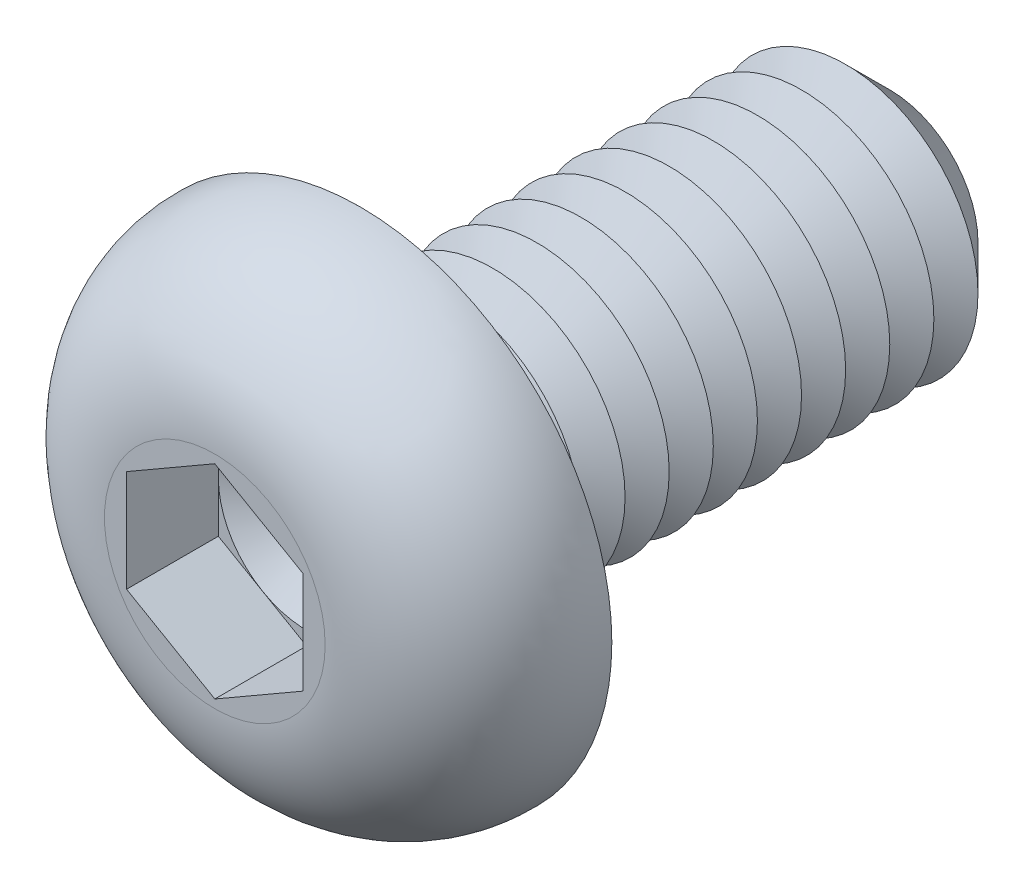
ISO-10303-21;
HEADER;
FILE_DESCRIPTION(('STEP AP214'),'2;1');
FILE_NAME('part.step','',(''),(''),'','','');
FILE_SCHEMA(('AUTOMOTIVE_DESIGN { 1 0 10303 214 1 1 1 1 }'));
ENDSEC;
DATA;
#1=APPLICATION_CONTEXT('core data for automotive mechanical design processes');
#2=APPLICATION_PROTOCOL_DEFINITION('international standard','automotive_design',2000,#1);
#3=PRODUCT_CONTEXT('',#1,'mechanical');
#4=PRODUCT('Part','Part','',(#3));
#5=PRODUCT_RELATED_PRODUCT_CATEGORY('part','',(#4));
#6=PRODUCT_DEFINITION_FORMATION('','',#4);
#7=PRODUCT_DEFINITION_CONTEXT('part definition',#1,'design');
#8=PRODUCT_DEFINITION('design','',#6,#7);
#9=PRODUCT_DEFINITION_SHAPE('','',#8);
#10=(LENGTH_UNIT() NAMED_UNIT(*) SI_UNIT(.MILLI.,.METRE.));
#11=(NAMED_UNIT(*) PLANE_ANGLE_UNIT() SI_UNIT($,.RADIAN.));
#12=(NAMED_UNIT(*) SI_UNIT($,.STERADIAN.) SOLID_ANGLE_UNIT());
#13=UNCERTAINTY_MEASURE_WITH_UNIT(LENGTH_MEASURE(1.E-05),#10,'distance_accuracy_value','');
#14=(GEOMETRIC_REPRESENTATION_CONTEXT(3) GLOBAL_UNCERTAINTY_ASSIGNED_CONTEXT((#13)) GLOBAL_UNIT_ASSIGNED_CONTEXT((#10,
#11,#12)) REPRESENTATION_CONTEXT('',''));
#15=CARTESIAN_POINT('',(0.,0.,0.));
#16=DIRECTION('',(0.,0.,1.));
#17=DIRECTION('',(1.,0.,0.));
#18=AXIS2_PLACEMENT_3D('',#15,#16,#17);
#19=CARTESIAN_POINT('',(0.,0.,0.61));
#20=DIRECTION('',(0.,0.,1.));
#21=DIRECTION('',(1.,0.,0.));
#22=AXIS2_PLACEMENT_3D('',#19,#20,#21);
#23=PLANE('',#22);
#24=CARTESIAN_POINT('',(0.,0.,0.61));
#25=DIRECTION('',(0.,0.,1.));
#26=DIRECTION('',(1.,0.,0.));
#27=AXIS2_PLACEMENT_3D('',#24,#25,#26);
#28=CIRCLE('',#27,1.);
#29=CARTESIAN_POINT('',(1.,0.,0.61));
#30=VERTEX_POINT('',#29);
#31=CARTESIAN_POINT('',(0.5,0.866025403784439,0.61));
#32=VERTEX_POINT('',#31);
#33=EDGE_CURVE('E117',#30,#32,#28,.T.);
#34=ORIENTED_EDGE('',*,*,#33,.F.);
#35=DIRECTION('',(0.,1.,0.));
#36=VECTOR('',#35,1.);
#37=CARTESIAN_POINT('',(1.,-0.577350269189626,0.61));
#38=LINE('',#37,#36);
#39=CARTESIAN_POINT('',(1.,0.577350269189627,0.61));
#40=VERTEX_POINT('',#39);
#41=EDGE_CURVE('E140',#30,#40,#38,.T.);
#42=ORIENTED_EDGE('',*,*,#41,.T.);
#43=DIRECTION('',(-0.866025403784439,0.5,0.));
#44=VECTOR('',#43,1.);
#45=CARTESIAN_POINT('',(1.,0.577350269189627,0.61));
#46=LINE('',#45,#44);
#47=EDGE_CURVE('E135',#40,#32,#46,.T.);
#48=ORIENTED_EDGE('',*,*,#47,.T.);
#49=EDGE_LOOP('',(#34,#42,#48));
#50=FACE_BOUND('',#49,.T.);
#51=ADVANCED_FACE('F39',(#50),#23,.T.);
#52=CARTESIAN_POINT('',(0.,0.,0.61));
#53=DIRECTION('',(0.,0.,1.));
#54=DIRECTION('',(1.,0.,0.));
#55=AXIS2_PLACEMENT_3D('',#52,#53,#54);
#56=CIRCLE('',#55,1.);
#57=CARTESIAN_POINT('',(-0.5,0.866025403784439,0.61));
#58=VERTEX_POINT('',#57);
#59=EDGE_CURVE('E11',#32,#58,#56,.T.);
#60=ORIENTED_EDGE('',*,*,#59,.F.);
#61=CARTESIAN_POINT('',(0.,1.15470053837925,0.61));
#62=VERTEX_POINT('',#61);
#63=EDGE_CURVE('E130',#32,#62,#46,.T.);
#64=ORIENTED_EDGE('',*,*,#63,.T.);
#65=DIRECTION('',(-0.866025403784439,-0.5,0.));
#66=VECTOR('',#65,1.);
#67=CARTESIAN_POINT('',(0.,1.15470053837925,0.61));
#68=LINE('',#67,#66);
#69=EDGE_CURVE('E132',#62,#58,#68,.T.);
#70=ORIENTED_EDGE('',*,*,#69,.T.);
#71=EDGE_LOOP('',(#60,#64,#70));
#72=FACE_BOUND('',#71,.T.);
#73=ADVANCED_FACE('F129',(#72),#23,.T.);
#74=CARTESIAN_POINT('',(-1.,0.,0.61));
#75=VERTEX_POINT('',#74);
#76=EDGE_CURVE('E49',#58,#75,#56,.T.);
#77=ORIENTED_EDGE('',*,*,#76,.F.);
#78=CARTESIAN_POINT('',(-1.,0.577350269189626,0.61));
#79=VERTEX_POINT('',#78);
#80=EDGE_CURVE('E143',#58,#79,#68,.T.);
#81=ORIENTED_EDGE('',*,*,#80,.T.);
#82=DIRECTION('',(0.,-1.,0.));
#83=VECTOR('',#82,1.);
#84=CARTESIAN_POINT('',(-1.,0.577350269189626,0.61));
#85=LINE('',#84,#83);
#86=EDGE_CURVE('E154',#79,#75,#85,.T.);
#87=ORIENTED_EDGE('',*,*,#86,.T.);
#88=EDGE_LOOP('',(#77,#81,#87));
#89=FACE_BOUND('',#88,.T.);
#90=ADVANCED_FACE('F248',(#89),#23,.T.);
#91=CARTESIAN_POINT('',(-0.5,-0.866025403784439,0.61));
#92=VERTEX_POINT('',#91);
#93=EDGE_CURVE('E234',#75,#92,#56,.T.);
#94=ORIENTED_EDGE('',*,*,#93,.F.);
#95=CARTESIAN_POINT('',(-1.,-0.577350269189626,0.61));
#96=VERTEX_POINT('',#95);
#97=EDGE_CURVE('E153',#75,#96,#85,.T.);
#98=ORIENTED_EDGE('',*,*,#97,.T.);
#99=DIRECTION('',(0.866025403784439,-0.5,0.));
#100=VECTOR('',#99,1.);
#101=CARTESIAN_POINT('',(-1.,-0.577350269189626,0.61));
#102=LINE('',#101,#100);
#103=EDGE_CURVE('E159',#96,#92,#102,.T.);
#104=ORIENTED_EDGE('',*,*,#103,.T.);
#105=EDGE_LOOP('',(#94,#98,#104));
#106=FACE_BOUND('',#105,.T.);
#107=ADVANCED_FACE('F241',(#106),#23,.T.);
#108=CARTESIAN_POINT('',(0.5,-0.866025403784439,0.61));
#109=VERTEX_POINT('',#108);
#110=EDGE_CURVE('E56',#92,#109,#56,.T.);
#111=ORIENTED_EDGE('',*,*,#110,.F.);
#112=CARTESIAN_POINT('',(0.,-1.15470053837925,0.61));
#113=VERTEX_POINT('',#112);
#114=EDGE_CURVE('E158',#92,#113,#102,.T.);
#115=ORIENTED_EDGE('',*,*,#114,.T.);
#116=DIRECTION('',(0.866025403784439,0.5,0.));
#117=VECTOR('',#116,1.);
#118=CARTESIAN_POINT('',(0.,-1.15470053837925,0.61));
#119=LINE('',#118,#117);
#120=EDGE_CURVE('E164',#113,#109,#119,.T.);
#121=ORIENTED_EDGE('',*,*,#120,.T.);
#122=EDGE_LOOP('',(#111,#115,#121));
#123=FACE_BOUND('',#122,.T.);
#124=ADVANCED_FACE('F374',(#123),#23,.T.);
#125=CARTESIAN_POINT('',(0.,0.,-6.));
#126=DIRECTION('',(0.,0.,1.));
#127=DIRECTION('',(1.,0.,0.));
#128=AXIS2_PLACEMENT_3D('',#125,#126,#127);
#129=CYLINDRICAL_SURFACE('',#128,1.5);
#130=CARTESIAN_POINT('',(0.,0.,-0.2));
#131=DIRECTION('',(0.,0.,1.));
#132=DIRECTION('',(1.,0.,0.));
#133=AXIS2_PLACEMENT_3D('',#130,#131,#132);
#134=CIRCLE('',#133,1.5);
#135=CARTESIAN_POINT('',(1.5,0.,-0.2));
#136=VERTEX_POINT('',#135);
#137=EDGE_CURVE('E222',#136,#136,#134,.F.);
#138=ORIENTED_EDGE('',*,*,#137,.T.);
#139=EDGE_LOOP('',(#138));
#140=FACE_BOUND('',#139,.T.);
#141=CARTESIAN_POINT('',(0.,0.,-0.5));
#142=DIRECTION('',(0.,0.,1.));
#143=DIRECTION('',(1.,0.,0.));
#144=AXIS2_PLACEMENT_3D('',#141,#142,#143);
#145=CIRCLE('',#144,1.50000000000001);
#146=CARTESIAN_POINT('',(1.50000000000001,0.,-0.5));
#147=VERTEX_POINT('',#146);
#148=EDGE_CURVE('E149',#147,#147,#145,.T.);
#149=ORIENTED_EDGE('',*,*,#148,.T.);
#150=EDGE_LOOP('',(#149));
#151=FACE_BOUND('',#150,.T.);
#152=ADVANCED_FACE('F384',(#140,#151),#129,.T.);
#153=CARTESIAN_POINT('',(0.,2.85,0.));
#154=DIRECTION('',(0.,0.,1.));
#155=DIRECTION('',(1.,0.,0.));
#156=AXIS2_PLACEMENT_3D('',#153,#154,#155);
#157=PLANE('',#156);
#158=CARTESIAN_POINT('',(0.,0.,0.));
#159=DIRECTION('',(0.,0.,1.));
#160=DIRECTION('',(1.,0.,0.));
#161=AXIS2_PLACEMENT_3D('',#158,#159,#160);
#162=CIRCLE('',#161,1.7);
#163=CARTESIAN_POINT('',(1.7,0.,0.));
#164=VERTEX_POINT('',#163);
#165=EDGE_CURVE('E225',#164,#164,#162,.T.);
#166=ORIENTED_EDGE('',*,*,#165,.T.);
#167=EDGE_LOOP('',(#166));
#168=FACE_BOUND('',#167,.T.);
#169=CARTESIAN_POINT('',(0.,0.,0.));
#170=DIRECTION('',(0.,0.,1.));
#171=DIRECTION('',(1.,0.,0.));
#172=AXIS2_PLACEMENT_3D('',#169,#170,#171);
#173=CIRCLE('',#172,2.85);
#174=CARTESIAN_POINT('',(2.85,0.,0.));
#175=VERTEX_POINT('',#174);
#176=EDGE_CURVE('E196',#175,#175,#173,.T.);
#177=ORIENTED_EDGE('',*,*,#176,.F.);
#178=EDGE_LOOP('',(#177));
#179=FACE_BOUND('',#178,.T.);
#180=ADVANCED_FACE('F389',(#168,#179),#157,.F.);
#181=CARTESIAN_POINT('',(0.,0.,1.65));
#182=DIRECTION('',(0.,0.,-1.));
#183=DIRECTION('',(-1.,0.,0.));
#184=AXIS2_PLACEMENT_3D('',#181,#182,#183);
#185=PLANE('',#184);
#186=DIRECTION('',(-0.866025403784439,-0.5,0.));
#187=VECTOR('',#186,1.);
#188=CARTESIAN_POINT('',(0.,1.15470053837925,1.65));
#189=LINE('',#188,#187);
#190=CARTESIAN_POINT('',(0.,1.15470053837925,1.65));
#191=VERTEX_POINT('',#190);
#192=CARTESIAN_POINT('',(-1.,0.577350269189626,1.65));
#193=VERTEX_POINT('',#192);
#194=EDGE_CURVE('E174',#191,#193,#189,.T.);
#195=ORIENTED_EDGE('',*,*,#194,.F.);
#196=DIRECTION('',(-0.866025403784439,0.5,0.));
#197=VECTOR('',#196,1.);
#198=CARTESIAN_POINT('',(1.,0.577350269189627,1.65));
#199=LINE('',#198,#197);
#200=CARTESIAN_POINT('',(1.,0.577350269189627,1.65));
#201=VERTEX_POINT('',#200);
#202=EDGE_CURVE('E64',#201,#191,#199,.T.);
#203=ORIENTED_EDGE('',*,*,#202,.F.);
#204=DIRECTION('',(0.,1.,0.));
#205=VECTOR('',#204,1.);
#206=CARTESIAN_POINT('',(1.,-0.577350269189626,1.65));
#207=LINE('',#206,#205);
#208=CARTESIAN_POINT('',(1.,-0.577350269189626,1.65));
#209=VERTEX_POINT('',#208);
#210=EDGE_CURVE('E138',#209,#201,#207,.T.);
#211=ORIENTED_EDGE('',*,*,#210,.F.);
#212=DIRECTION('',(0.866025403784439,0.5,0.));
#213=VECTOR('',#212,1.);
#214=CARTESIAN_POINT('',(0.,-1.15470053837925,1.65));
#215=LINE('',#214,#213);
#216=CARTESIAN_POINT('',(0.,-1.15470053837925,1.65));
#217=VERTEX_POINT('',#216);
#218=EDGE_CURVE('E186',#217,#209,#215,.T.);
#219=ORIENTED_EDGE('',*,*,#218,.F.);
#220=DIRECTION('',(0.866025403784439,-0.5,0.));
#221=VECTOR('',#220,1.);
#222=CARTESIAN_POINT('',(-1.,-0.577350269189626,1.65));
#223=LINE('',#222,#221);
#224=CARTESIAN_POINT('',(-1.,-0.577350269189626,1.65));
#225=VERTEX_POINT('',#224);
#226=EDGE_CURVE('E182',#225,#217,#223,.T.);
#227=ORIENTED_EDGE('',*,*,#226,.F.);
#228=DIRECTION('',(0.,-1.,0.));
#229=VECTOR('',#228,1.);
#230=CARTESIAN_POINT('',(-1.,0.577350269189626,1.65));
#231=LINE('',#230,#229);
#232=EDGE_CURVE('E178',#193,#225,#231,.T.);
#233=ORIENTED_EDGE('',*,*,#232,.F.);
#234=EDGE_LOOP('',(#195,#203,#211,#219,#227,#233));
#235=FACE_BOUND('',#234,.T.);
#236=CARTESIAN_POINT('',(0.,0.,1.65));
#237=DIRECTION('',(0.,0.,1.));
#238=DIRECTION('',(1.,0.,0.));
#239=AXIS2_PLACEMENT_3D('',#236,#237,#238);
#240=CIRCLE('',#239,1.25078144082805);
#241=CARTESIAN_POINT('',(1.25078144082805,0.,1.65));
#242=VERTEX_POINT('',#241);
#243=EDGE_CURVE('E214',#242,#242,#240,.T.);
#244=ORIENTED_EDGE('',*,*,#243,.T.);
#245=EDGE_LOOP('',(#244));
#246=FACE_BOUND('',#245,.T.);
#247=ADVANCED_FACE('F257',(#235,#246),#185,.F.);
#248=CARTESIAN_POINT('',(0.,0.,0.0499999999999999));
#249=DIRECTION('',(0.,0.,1.));
#250=DIRECTION('',(1.,0.,0.));
#251=AXIS2_PLACEMENT_3D('',#248,#249,#250);
#252=DEGENERATE_TOROIDAL_SURFACE('',#251,1.25078144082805,1.6,.T.);
#253=ORIENTED_EDGE('',*,*,#243,.F.);
#254=EDGE_LOOP('',(#253));
#255=FACE_BOUND('',#254,.T.);
#256=ORIENTED_EDGE('',*,*,#176,.T.);
#257=EDGE_LOOP('',(#256));
#258=FACE_BOUND('',#257,.T.);
#259=ADVANCED_FACE('F411',(#255,#258),#252,.T.);
#260=CARTESIAN_POINT('',(1.,0.577350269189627,0.61));
#261=DIRECTION('',(0.5,0.866025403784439,0.));
#262=DIRECTION('',(-0.866025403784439,0.5,0.));
#263=AXIS2_PLACEMENT_3D('',#260,#261,#262);
#264=PLANE('',#263);
#265=ORIENTED_EDGE('',*,*,#202,.T.);
#266=DIRECTION('',(0.,0.,1.));
#267=VECTOR('',#266,1.);
#268=CARTESIAN_POINT('',(0.,1.15470053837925,0.61));
#269=LINE('',#268,#267);
#270=EDGE_CURVE('E136',#62,#191,#269,.T.);
#271=ORIENTED_EDGE('',*,*,#270,.F.);
#272=ORIENTED_EDGE('',*,*,#63,.F.);
#273=ORIENTED_EDGE('',*,*,#47,.F.);
#274=DIRECTION('',(0.,0.,1.));
#275=VECTOR('',#274,1.);
#276=CARTESIAN_POINT('',(1.,0.577350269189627,0.61));
#277=LINE('',#276,#275);
#278=EDGE_CURVE('E193',#40,#201,#277,.T.);
#279=ORIENTED_EDGE('',*,*,#278,.T.);
#280=EDGE_LOOP('',(#265,#271,#272,#273,#279));
#281=FACE_BOUND('',#280,.T.);
#282=ADVANCED_FACE('F134',(#281),#264,.F.);
#283=CARTESIAN_POINT('',(1.,-0.577350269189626,0.61));
#284=DIRECTION('',(1.,0.,0.));
#285=DIRECTION('',(0.,0.,-1.));
#286=AXIS2_PLACEMENT_3D('',#283,#284,#285);
#287=PLANE('',#286);
#288=ORIENTED_EDGE('',*,*,#210,.T.);
#289=ORIENTED_EDGE('',*,*,#278,.F.);
#290=ORIENTED_EDGE('',*,*,#41,.F.);
#291=CARTESIAN_POINT('',(1.,-0.577350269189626,0.61));
#292=VERTEX_POINT('',#291);
#293=EDGE_CURVE('E168',#292,#30,#38,.T.);
#294=ORIENTED_EDGE('',*,*,#293,.F.);
#295=DIRECTION('',(0.,0.,1.));
#296=VECTOR('',#295,1.);
#297=CARTESIAN_POINT('',(1.,-0.577350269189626,0.61));
#298=LINE('',#297,#296);
#299=EDGE_CURVE('E197',#292,#209,#298,.T.);
#300=ORIENTED_EDGE('',*,*,#299,.T.);
#301=EDGE_LOOP('',(#288,#289,#290,#294,#300));
#302=FACE_BOUND('',#301,.T.);
#303=ADVANCED_FACE('F404',(#302),#287,.F.);
#304=CARTESIAN_POINT('',(0.,-1.15470053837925,0.61));
#305=DIRECTION('',(0.5,-0.866025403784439,0.));
#306=DIRECTION('',(0.866025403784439,0.5,0.));
#307=AXIS2_PLACEMENT_3D('',#304,#305,#306);
#308=PLANE('',#307);
#309=ORIENTED_EDGE('',*,*,#218,.T.);
#310=ORIENTED_EDGE('',*,*,#299,.F.);
#311=EDGE_CURVE('E163',#109,#292,#119,.T.);
#312=ORIENTED_EDGE('',*,*,#311,.F.);
#313=ORIENTED_EDGE('',*,*,#120,.F.);
#314=DIRECTION('',(0.,0.,1.));
#315=VECTOR('',#314,1.);
#316=CARTESIAN_POINT('',(0.,-1.15470053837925,0.61));
#317=LINE('',#316,#315);
#318=EDGE_CURVE('E200',#113,#217,#317,.T.);
#319=ORIENTED_EDGE('',*,*,#318,.T.);
#320=EDGE_LOOP('',(#309,#310,#312,#313,#319));
#321=FACE_BOUND('',#320,.T.);
#322=ADVANCED_FACE('F393',(#321),#308,.F.);
#323=CARTESIAN_POINT('',(-1.,-0.577350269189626,0.61));
#324=DIRECTION('',(-0.5,-0.866025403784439,0.));
#325=DIRECTION('',(0.866025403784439,-0.5,0.));
#326=AXIS2_PLACEMENT_3D('',#323,#324,#325);
#327=PLANE('',#326);
#328=ORIENTED_EDGE('',*,*,#226,.T.);
#329=ORIENTED_EDGE('',*,*,#318,.F.);
#330=ORIENTED_EDGE('',*,*,#114,.F.);
#331=ORIENTED_EDGE('',*,*,#103,.F.);
#332=DIRECTION('',(0.,0.,1.));
#333=VECTOR('',#332,1.);
#334=CARTESIAN_POINT('',(-1.,-0.577350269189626,0.61));
#335=LINE('',#334,#333);
#336=EDGE_CURVE('E203',#96,#225,#335,.T.);
#337=ORIENTED_EDGE('',*,*,#336,.T.);
#338=EDGE_LOOP('',(#328,#329,#330,#331,#337));
#339=FACE_BOUND('',#338,.T.);
#340=ADVANCED_FACE('F262',(#339),#327,.F.);
#341=CARTESIAN_POINT('',(-1.,0.577350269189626,0.61));
#342=DIRECTION('',(-1.,0.,0.));
#343=DIRECTION('',(0.,-1.,0.));
#344=AXIS2_PLACEMENT_3D('',#341,#342,#343);
#345=PLANE('',#344);
#346=ORIENTED_EDGE('',*,*,#232,.T.);
#347=ORIENTED_EDGE('',*,*,#336,.F.);
#348=ORIENTED_EDGE('',*,*,#97,.F.);
#349=ORIENTED_EDGE('',*,*,#86,.F.);
#350=DIRECTION('',(0.,0.,1.));
#351=VECTOR('',#350,1.);
#352=CARTESIAN_POINT('',(-1.,0.577350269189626,0.61));
#353=LINE('',#352,#351);
#354=EDGE_CURVE('E206',#79,#193,#353,.T.);
#355=ORIENTED_EDGE('',*,*,#354,.T.);
#356=EDGE_LOOP('',(#346,#347,#348,#349,#355));
#357=FACE_BOUND('',#356,.T.);
#358=ADVANCED_FACE('F246',(#357),#345,.F.);
#359=CARTESIAN_POINT('',(0.,1.15470053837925,0.61));
#360=DIRECTION('',(-0.5,0.866025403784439,0.));
#361=DIRECTION('',(-0.866025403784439,-0.5,0.));
#362=AXIS2_PLACEMENT_3D('',#359,#360,#361);
#363=PLANE('',#362);
#364=ORIENTED_EDGE('',*,*,#194,.T.);
#365=ORIENTED_EDGE('',*,*,#354,.F.);
#366=ORIENTED_EDGE('',*,*,#80,.F.);
#367=ORIENTED_EDGE('',*,*,#69,.F.);
#368=ORIENTED_EDGE('',*,*,#270,.T.);
#369=EDGE_LOOP('',(#364,#365,#366,#367,#368));
#370=FACE_BOUND('',#369,.T.);
#371=ADVANCED_FACE('F251',(#370),#363,.F.);
#372=EDGE_CURVE('E43',#109,#30,#56,.T.);
#373=ORIENTED_EDGE('',*,*,#372,.F.);
#374=ORIENTED_EDGE('',*,*,#311,.T.);
#375=ORIENTED_EDGE('',*,*,#293,.T.);
#376=EDGE_LOOP('',(#373,#374,#375));
#377=FACE_BOUND('',#376,.T.);
#378=ADVANCED_FACE('F365',(#377),#23,.T.);
#379=CARTESIAN_POINT('',(0.,0.,-0.5));
#380=DIRECTION('',(0.,0.,1.));
#381=DIRECTION('',(1.,0.,0.));
#382=AXIS2_PLACEMENT_3D('',#379,#380,#381);
#383=CONICAL_SURFACE('',#382,1.50000000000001,1.0471975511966);
#384=CARTESIAN_POINT('',(0.,0.,-0.750000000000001));
#385=DIRECTION('',(0.,0.,1.));
#386=DIRECTION('',(1.,0.,0.));
#387=AXIS2_PLACEMENT_3D('',#384,#385,#386);
#388=CIRCLE('',#387,1.06698729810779);
#389=CARTESIAN_POINT('',(1.06698729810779,0.,-0.750000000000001));
#390=VERTEX_POINT('',#389);
#391=EDGE_CURVE('E287',#390,#390,#388,.T.);
#392=ORIENTED_EDGE('',*,*,#391,.T.);
#393=EDGE_LOOP('',(#392));
#394=FACE_BOUND('',#393,.T.);
#395=ORIENTED_EDGE('',*,*,#148,.F.);
#396=EDGE_LOOP('',(#395));
#397=FACE_BOUND('',#396,.T.);
#398=ADVANCED_FACE('F372',(#394,#397),#383,.T.);
#399=CARTESIAN_POINT('',(0.,0.,-0.750000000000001));
#400=DIRECTION('',(0.,0.,-1.));
#401=DIRECTION('',(-1.,0.,0.));
#402=AXIS2_PLACEMENT_3D('',#399,#400,#401);
#403=CONICAL_SURFACE('',#402,1.06698729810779,1.0471975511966);
#404=CARTESIAN_POINT('',(0.,0.,-1.));
#405=DIRECTION('',(0.,0.,1.));
#406=DIRECTION('',(1.,0.,0.));
#407=AXIS2_PLACEMENT_3D('',#404,#405,#406);
#408=CIRCLE('',#407,1.50000000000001);
#409=CARTESIAN_POINT('',(1.50000000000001,0.,-1.));
#410=VERTEX_POINT('',#409);
#411=EDGE_CURVE('E271',#410,#410,#408,.T.);
#412=ORIENTED_EDGE('',*,*,#411,.T.);
#413=EDGE_LOOP('',(#412));
#414=FACE_BOUND('',#413,.T.);
#415=ORIENTED_EDGE('',*,*,#391,.F.);
#416=EDGE_LOOP('',(#415));
#417=FACE_BOUND('',#416,.T.);
#418=ADVANCED_FACE('F379',(#414,#417),#403,.T.);
#419=CARTESIAN_POINT('',(0.,0.,-1.));
#420=DIRECTION('',(0.,0.,1.));
#421=DIRECTION('',(1.,0.,0.));
#422=AXIS2_PLACEMENT_3D('',#419,#420,#421);
#423=CONICAL_SURFACE('',#422,1.50000000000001,1.0471975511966);
#424=CARTESIAN_POINT('',(0.,0.,-1.25));
#425=DIRECTION('',(0.,0.,1.));
#426=DIRECTION('',(1.,0.,0.));
#427=AXIS2_PLACEMENT_3D('',#424,#425,#426);
#428=CIRCLE('',#427,1.06698729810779);
#429=CARTESIAN_POINT('',(1.06698729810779,0.,-1.25));
#430=VERTEX_POINT('',#429);
#431=EDGE_CURVE('E268',#430,#430,#428,.T.);
#432=ORIENTED_EDGE('',*,*,#431,.T.);
#433=EDGE_LOOP('',(#432));
#434=FACE_BOUND('',#433,.T.);
#435=ORIENTED_EDGE('',*,*,#411,.F.);
#436=EDGE_LOOP('',(#435));
#437=FACE_BOUND('',#436,.T.);
#438=ADVANCED_FACE('F696',(#434,#437),#423,.T.);
#439=CARTESIAN_POINT('',(0.,0.,-1.25));
#440=DIRECTION('',(0.,0.,-1.));
#441=DIRECTION('',(-1.,0.,0.));
#442=AXIS2_PLACEMENT_3D('',#439,#440,#441);
#443=CONICAL_SURFACE('',#442,1.06698729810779,1.0471975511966);
#444=CARTESIAN_POINT('',(0.,0.,-1.5));
#445=DIRECTION('',(0.,0.,1.));
#446=DIRECTION('',(1.,0.,0.));
#447=AXIS2_PLACEMENT_3D('',#444,#445,#446);
#448=CIRCLE('',#447,1.50000000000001);
#449=CARTESIAN_POINT('',(1.50000000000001,0.,-1.5));
#450=VERTEX_POINT('',#449);
#451=EDGE_CURVE('E272',#450,#450,#448,.T.);
#452=ORIENTED_EDGE('',*,*,#451,.T.);
#453=EDGE_LOOP('',(#452));
#454=FACE_BOUND('',#453,.T.);
#455=ORIENTED_EDGE('',*,*,#431,.F.);
#456=EDGE_LOOP('',(#455));
#457=FACE_BOUND('',#456,.T.);
#458=ADVANCED_FACE('F686',(#454,#457),#443,.T.);
#459=CARTESIAN_POINT('',(0.,0.,-1.5));
#460=DIRECTION('',(0.,0.,1.));
#461=DIRECTION('',(1.,0.,0.));
#462=AXIS2_PLACEMENT_3D('',#459,#460,#461);
#463=CONICAL_SURFACE('',#462,1.50000000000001,1.0471975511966);
#464=CARTESIAN_POINT('',(0.,0.,-1.75));
#465=DIRECTION('',(0.,0.,1.));
#466=DIRECTION('',(1.,0.,0.));
#467=AXIS2_PLACEMENT_3D('',#464,#465,#466);
#468=CIRCLE('',#467,1.06698729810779);
#469=CARTESIAN_POINT('',(1.06698729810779,0.,-1.75));
#470=VERTEX_POINT('',#469);
#471=EDGE_CURVE('E297',#470,#470,#468,.T.);
#472=ORIENTED_EDGE('',*,*,#471,.T.);
#473=EDGE_LOOP('',(#472));
#474=FACE_BOUND('',#473,.T.);
#475=ORIENTED_EDGE('',*,*,#451,.F.);
#476=EDGE_LOOP('',(#475));
#477=FACE_BOUND('',#476,.T.);
#478=ADVANCED_FACE('F676',(#474,#477),#463,.T.);
#479=CARTESIAN_POINT('',(0.,0.,-1.75));
#480=DIRECTION('',(0.,0.,-1.));
#481=DIRECTION('',(-1.,0.,0.));
#482=AXIS2_PLACEMENT_3D('',#479,#480,#481);
#483=CONICAL_SURFACE('',#482,1.06698729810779,1.0471975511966);
#484=CARTESIAN_POINT('',(0.,0.,-2.));
#485=DIRECTION('',(0.,0.,1.));
#486=DIRECTION('',(1.,0.,0.));
#487=AXIS2_PLACEMENT_3D('',#484,#485,#486);
#488=CIRCLE('',#487,1.50000000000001);
#489=CARTESIAN_POINT('',(1.50000000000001,0.,-2.));
#490=VERTEX_POINT('',#489);
#491=EDGE_CURVE('E300',#490,#490,#488,.T.);
#492=ORIENTED_EDGE('',*,*,#491,.T.);
#493=EDGE_LOOP('',(#492));
#494=FACE_BOUND('',#493,.T.);
#495=ORIENTED_EDGE('',*,*,#471,.F.);
#496=EDGE_LOOP('',(#495));
#497=FACE_BOUND('',#496,.T.);
#498=ADVANCED_FACE('F666',(#494,#497),#483,.T.);
#499=CARTESIAN_POINT('',(0.,0.,-2.));
#500=DIRECTION('',(0.,0.,1.));
#501=DIRECTION('',(1.,0.,0.));
#502=AXIS2_PLACEMENT_3D('',#499,#500,#501);
#503=CONICAL_SURFACE('',#502,1.50000000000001,1.0471975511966);
#504=CARTESIAN_POINT('',(0.,0.,-2.25));
#505=DIRECTION('',(0.,0.,1.));
#506=DIRECTION('',(1.,0.,0.));
#507=AXIS2_PLACEMENT_3D('',#504,#505,#506);
#508=CIRCLE('',#507,1.06698729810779);
#509=CARTESIAN_POINT('',(1.06698729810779,0.,-2.25));
#510=VERTEX_POINT('',#509);
#511=EDGE_CURVE('E276',#510,#510,#508,.T.);
#512=ORIENTED_EDGE('',*,*,#511,.T.);
#513=EDGE_LOOP('',(#512));
#514=FACE_BOUND('',#513,.T.);
#515=ORIENTED_EDGE('',*,*,#491,.F.);
#516=EDGE_LOOP('',(#515));
#517=FACE_BOUND('',#516,.T.);
#518=ADVANCED_FACE('F656',(#514,#517),#503,.T.);
#519=CARTESIAN_POINT('',(0.,0.,-2.25));
#520=DIRECTION('',(0.,0.,-1.));
#521=DIRECTION('',(-1.,0.,0.));
#522=AXIS2_PLACEMENT_3D('',#519,#520,#521);
#523=CONICAL_SURFACE('',#522,1.06698729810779,1.0471975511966);
#524=CARTESIAN_POINT('',(0.,0.,-2.5));
#525=DIRECTION('',(0.,0.,1.));
#526=DIRECTION('',(1.,0.,0.));
#527=AXIS2_PLACEMENT_3D('',#524,#525,#526);
#528=CIRCLE('',#527,1.50000000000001);
#529=CARTESIAN_POINT('',(1.50000000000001,0.,-2.5));
#530=VERTEX_POINT('',#529);
#531=EDGE_CURVE('E274',#530,#530,#528,.T.);
#532=ORIENTED_EDGE('',*,*,#531,.T.);
#533=EDGE_LOOP('',(#532));
#534=FACE_BOUND('',#533,.T.);
#535=ORIENTED_EDGE('',*,*,#511,.F.);
#536=EDGE_LOOP('',(#535));
#537=FACE_BOUND('',#536,.T.);
#538=ADVANCED_FACE('F646',(#534,#537),#523,.T.);
#539=CARTESIAN_POINT('',(0.,0.,-2.5));
#540=DIRECTION('',(0.,0.,1.));
#541=DIRECTION('',(1.,0.,0.));
#542=AXIS2_PLACEMENT_3D('',#539,#540,#541);
#543=CONICAL_SURFACE('',#542,1.50000000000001,1.0471975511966);
#544=CARTESIAN_POINT('',(0.,0.,-2.75));
#545=DIRECTION('',(0.,0.,1.));
#546=DIRECTION('',(1.,0.,0.));
#547=AXIS2_PLACEMENT_3D('',#544,#545,#546);
#548=CIRCLE('',#547,1.06698729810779);
#549=CARTESIAN_POINT('',(1.06698729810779,0.,-2.75));
#550=VERTEX_POINT('',#549);
#551=EDGE_CURVE('E277',#550,#550,#548,.T.);
#552=ORIENTED_EDGE('',*,*,#551,.T.);
#553=EDGE_LOOP('',(#552));
#554=FACE_BOUND('',#553,.T.);
#555=ORIENTED_EDGE('',*,*,#531,.F.);
#556=EDGE_LOOP('',(#555));
#557=FACE_BOUND('',#556,.T.);
#558=ADVANCED_FACE('F636',(#554,#557),#543,.T.);
#559=CARTESIAN_POINT('',(0.,0.,-2.75));
#560=DIRECTION('',(0.,0.,-1.));
#561=DIRECTION('',(-1.,0.,0.));
#562=AXIS2_PLACEMENT_3D('',#559,#560,#561);
#563=CONICAL_SURFACE('',#562,1.06698729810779,1.0471975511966);
#564=CARTESIAN_POINT('',(0.,0.,-3.));
#565=DIRECTION('',(0.,0.,1.));
#566=DIRECTION('',(1.,0.,0.));
#567=AXIS2_PLACEMENT_3D('',#564,#565,#566);
#568=CIRCLE('',#567,1.50000000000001);
#569=CARTESIAN_POINT('',(1.50000000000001,0.,-3.));
#570=VERTEX_POINT('',#569);
#571=EDGE_CURVE('E310',#570,#570,#568,.T.);
#572=ORIENTED_EDGE('',*,*,#571,.T.);
#573=EDGE_LOOP('',(#572));
#574=FACE_BOUND('',#573,.T.);
#575=ORIENTED_EDGE('',*,*,#551,.F.);
#576=EDGE_LOOP('',(#575));
#577=FACE_BOUND('',#576,.T.);
#578=ADVANCED_FACE('F626',(#574,#577),#563,.T.);
#579=CARTESIAN_POINT('',(0.,0.,-3.));
#580=DIRECTION('',(0.,0.,1.));
#581=DIRECTION('',(1.,0.,0.));
#582=AXIS2_PLACEMENT_3D('',#579,#580,#581);
#583=CONICAL_SURFACE('',#582,1.50000000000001,1.0471975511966);
#584=CARTESIAN_POINT('',(0.,0.,-3.25));
#585=DIRECTION('',(0.,0.,1.));
#586=DIRECTION('',(1.,0.,0.));
#587=AXIS2_PLACEMENT_3D('',#584,#585,#586);
#588=CIRCLE('',#587,1.06698729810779);
#589=CARTESIAN_POINT('',(1.06698729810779,0.,-3.25));
#590=VERTEX_POINT('',#589);
#591=EDGE_CURVE('E314',#590,#590,#588,.T.);
#592=ORIENTED_EDGE('',*,*,#591,.T.);
#593=EDGE_LOOP('',(#592));
#594=FACE_BOUND('',#593,.T.);
#595=ORIENTED_EDGE('',*,*,#571,.F.);
#596=EDGE_LOOP('',(#595));
#597=FACE_BOUND('',#596,.T.);
#598=ADVANCED_FACE('F616',(#594,#597),#583,.T.);
#599=CARTESIAN_POINT('',(0.,0.,-3.25));
#600=DIRECTION('',(0.,0.,-1.));
#601=DIRECTION('',(-1.,0.,0.));
#602=AXIS2_PLACEMENT_3D('',#599,#600,#601);
#603=CONICAL_SURFACE('',#602,1.06698729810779,1.0471975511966);
#604=CARTESIAN_POINT('',(0.,0.,-3.5));
#605=DIRECTION('',(0.,0.,1.));
#606=DIRECTION('',(1.,0.,0.));
#607=AXIS2_PLACEMENT_3D('',#604,#605,#606);
#608=CIRCLE('',#607,1.50000000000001);
#609=CARTESIAN_POINT('',(1.50000000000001,0.,-3.5));
#610=VERTEX_POINT('',#609);
#611=EDGE_CURVE('E318',#610,#610,#608,.T.);
#612=ORIENTED_EDGE('',*,*,#611,.T.);
#613=EDGE_LOOP('',(#612));
#614=FACE_BOUND('',#613,.T.);
#615=ORIENTED_EDGE('',*,*,#591,.F.);
#616=EDGE_LOOP('',(#615));
#617=FACE_BOUND('',#616,.T.);
#618=ADVANCED_FACE('F606',(#614,#617),#603,.T.);
#619=CARTESIAN_POINT('',(0.,0.,-3.5));
#620=DIRECTION('',(0.,0.,1.));
#621=DIRECTION('',(1.,0.,0.));
#622=AXIS2_PLACEMENT_3D('',#619,#620,#621);
#623=CONICAL_SURFACE('',#622,1.50000000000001,1.0471975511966);
#624=CARTESIAN_POINT('',(0.,0.,-3.75));
#625=DIRECTION('',(0.,0.,1.));
#626=DIRECTION('',(1.,0.,0.));
#627=AXIS2_PLACEMENT_3D('',#624,#625,#626);
#628=CIRCLE('',#627,1.06698729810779);
#629=CARTESIAN_POINT('',(1.06698729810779,0.,-3.75));
#630=VERTEX_POINT('',#629);
#631=EDGE_CURVE('E283',#630,#630,#628,.T.);
#632=ORIENTED_EDGE('',*,*,#631,.T.);
#633=EDGE_LOOP('',(#632));
#634=FACE_BOUND('',#633,.T.);
#635=ORIENTED_EDGE('',*,*,#611,.F.);
#636=EDGE_LOOP('',(#635));
#637=FACE_BOUND('',#636,.T.);
#638=ADVANCED_FACE('F596',(#634,#637),#623,.T.);
#639=CARTESIAN_POINT('',(0.,0.,-3.75));
#640=DIRECTION('',(0.,0.,-1.));
#641=DIRECTION('',(-1.,0.,0.));
#642=AXIS2_PLACEMENT_3D('',#639,#640,#641);
#643=CONICAL_SURFACE('',#642,1.06698729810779,1.0471975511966);
#644=CARTESIAN_POINT('',(0.,0.,-4.));
#645=DIRECTION('',(0.,0.,1.));
#646=DIRECTION('',(1.,0.,0.));
#647=AXIS2_PLACEMENT_3D('',#644,#645,#646);
#648=CIRCLE('',#647,1.50000000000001);
#649=CARTESIAN_POINT('',(1.50000000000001,0.,-4.));
#650=VERTEX_POINT('',#649);
#651=EDGE_CURVE('E280',#650,#650,#648,.T.);
#652=ORIENTED_EDGE('',*,*,#651,.T.);
#653=EDGE_LOOP('',(#652));
#654=FACE_BOUND('',#653,.T.);
#655=ORIENTED_EDGE('',*,*,#631,.F.);
#656=EDGE_LOOP('',(#655));
#657=FACE_BOUND('',#656,.T.);
#658=ADVANCED_FACE('F586',(#654,#657),#643,.T.);
#659=CARTESIAN_POINT('',(0.,0.,-4.));
#660=DIRECTION('',(0.,0.,1.));
#661=DIRECTION('',(1.,0.,0.));
#662=AXIS2_PLACEMENT_3D('',#659,#660,#661);
#663=CONICAL_SURFACE('',#662,1.50000000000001,1.0471975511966);
#664=CARTESIAN_POINT('',(0.,0.,-4.25));
#665=DIRECTION('',(0.,0.,1.));
#666=DIRECTION('',(1.,0.,0.));
#667=AXIS2_PLACEMENT_3D('',#664,#665,#666);
#668=CIRCLE('',#667,1.06698729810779);
#669=CARTESIAN_POINT('',(1.06698729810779,0.,-4.25));
#670=VERTEX_POINT('',#669);
#671=EDGE_CURVE('E284',#670,#670,#668,.T.);
#672=ORIENTED_EDGE('',*,*,#671,.T.);
#673=EDGE_LOOP('',(#672));
#674=FACE_BOUND('',#673,.T.);
#675=ORIENTED_EDGE('',*,*,#651,.F.);
#676=EDGE_LOOP('',(#675));
#677=FACE_BOUND('',#676,.T.);
#678=ADVANCED_FACE('F576',(#674,#677),#663,.T.);
#679=CARTESIAN_POINT('',(0.,0.,-4.25));
#680=DIRECTION('',(0.,0.,-1.));
#681=DIRECTION('',(-1.,0.,0.));
#682=AXIS2_PLACEMENT_3D('',#679,#680,#681);
#683=CONICAL_SURFACE('',#682,1.06698729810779,1.0471975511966);
#684=CARTESIAN_POINT('',(0.,0.,-4.5));
#685=DIRECTION('',(0.,0.,1.));
#686=DIRECTION('',(1.,0.,0.));
#687=AXIS2_PLACEMENT_3D('',#684,#685,#686);
#688=CIRCLE('',#687,1.50000000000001);
#689=CARTESIAN_POINT('',(1.50000000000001,0.,-4.5));
#690=VERTEX_POINT('',#689);
#691=EDGE_CURVE('E328',#690,#690,#688,.T.);
#692=ORIENTED_EDGE('',*,*,#691,.T.);
#693=EDGE_LOOP('',(#692));
#694=FACE_BOUND('',#693,.T.);
#695=ORIENTED_EDGE('',*,*,#671,.F.);
#696=EDGE_LOOP('',(#695));
#697=FACE_BOUND('',#696,.T.);
#698=ADVANCED_FACE('F566',(#694,#697),#683,.T.);
#699=CARTESIAN_POINT('',(0.,0.,-4.5));
#700=DIRECTION('',(0.,0.,1.));
#701=DIRECTION('',(1.,0.,0.));
#702=AXIS2_PLACEMENT_3D('',#699,#700,#701);
#703=CONICAL_SURFACE('',#702,1.50000000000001,1.0471975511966);
#704=CARTESIAN_POINT('',(0.,0.,-4.75));
#705=DIRECTION('',(0.,0.,1.));
#706=DIRECTION('',(1.,0.,0.));
#707=AXIS2_PLACEMENT_3D('',#704,#705,#706);
#708=CIRCLE('',#707,1.06698729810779);
#709=CARTESIAN_POINT('',(1.06698729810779,0.,-4.75));
#710=VERTEX_POINT('',#709);
#711=EDGE_CURVE('E331',#710,#710,#708,.T.);
#712=ORIENTED_EDGE('',*,*,#711,.T.);
#713=EDGE_LOOP('',(#712));
#714=FACE_BOUND('',#713,.T.);
#715=ORIENTED_EDGE('',*,*,#691,.F.);
#716=EDGE_LOOP('',(#715));
#717=FACE_BOUND('',#716,.T.);
#718=ADVANCED_FACE('F556',(#714,#717),#703,.T.);
#719=CARTESIAN_POINT('',(0.,0.,-4.75));
#720=DIRECTION('',(0.,0.,-1.));
#721=DIRECTION('',(-1.,0.,0.));
#722=AXIS2_PLACEMENT_3D('',#719,#720,#721);
#723=CONICAL_SURFACE('',#722,1.06698729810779,1.0471975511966);
#724=CARTESIAN_POINT('',(0.,0.,-5.));
#725=DIRECTION('',(0.,0.,1.));
#726=DIRECTION('',(1.,0.,0.));
#727=AXIS2_PLACEMENT_3D('',#724,#725,#726);
#728=CIRCLE('',#727,1.50000000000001);
#729=CARTESIAN_POINT('',(1.50000000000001,0.,-5.));
#730=VERTEX_POINT('',#729);
#731=EDGE_CURVE('E335',#730,#730,#728,.T.);
#732=ORIENTED_EDGE('',*,*,#731,.T.);
#733=EDGE_LOOP('',(#732));
#734=FACE_BOUND('',#733,.T.);
#735=ORIENTED_EDGE('',*,*,#711,.F.);
#736=EDGE_LOOP('',(#735));
#737=FACE_BOUND('',#736,.T.);
#738=ADVANCED_FACE('F361',(#734,#737),#723,.T.);
#739=CARTESIAN_POINT('',(0.,0.,-5.));
#740=DIRECTION('',(0.,0.,1.));
#741=DIRECTION('',(1.,0.,0.));
#742=AXIS2_PLACEMENT_3D('',#739,#740,#741);
#743=CONICAL_SURFACE('',#742,1.50000000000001,1.0471975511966);
#744=CARTESIAN_POINT('',(0.,0.,-5.25));
#745=DIRECTION('',(0.,0.,1.));
#746=DIRECTION('',(1.,0.,0.));
#747=AXIS2_PLACEMENT_3D('',#744,#745,#746);
#748=CIRCLE('',#747,1.06698729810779);
#749=CARTESIAN_POINT('',(1.06698729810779,0.,-5.25));
#750=VERTEX_POINT('',#749);
#751=EDGE_CURVE('E124',#750,#750,#748,.T.);
#752=ORIENTED_EDGE('',*,*,#751,.T.);
#753=EDGE_LOOP('',(#752));
#754=FACE_BOUND('',#753,.T.);
#755=ORIENTED_EDGE('',*,*,#731,.F.);
#756=EDGE_LOOP('',(#755));
#757=FACE_BOUND('',#756,.T.);
#758=ADVANCED_FACE('F346',(#754,#757),#743,.T.);
#759=CARTESIAN_POINT('',(0.,0.,-5.25));
#760=DIRECTION('',(0.,0.,-1.));
#761=DIRECTION('',(-1.,0.,0.));
#762=AXIS2_PLACEMENT_3D('',#759,#760,#761);
#763=CONICAL_SURFACE('',#762,1.06698729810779,1.0471975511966);
#764=CARTESIAN_POINT('',(0.,0.,-5.5));
#765=DIRECTION('',(0.,0.,1.));
#766=DIRECTION('',(1.,0.,0.));
#767=AXIS2_PLACEMENT_3D('',#764,#765,#766);
#768=CIRCLE('',#767,1.50000000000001);
#769=CARTESIAN_POINT('',(1.50000000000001,0.,-5.5));
#770=VERTEX_POINT('',#769);
#771=EDGE_CURVE('E339',#770,#770,#768,.T.);
#772=ORIENTED_EDGE('',*,*,#771,.T.);
#773=EDGE_LOOP('',(#772));
#774=FACE_BOUND('',#773,.T.);
#775=ORIENTED_EDGE('',*,*,#751,.F.);
#776=EDGE_LOOP('',(#775));
#777=FACE_BOUND('',#776,.T.);
#778=ADVANCED_FACE('F349',(#774,#777),#763,.T.);
#779=CARTESIAN_POINT('',(0.,0.,-6.));
#780=DIRECTION('',(0.,0.,-1.));
#781=DIRECTION('',(-1.,0.,0.));
#782=AXIS2_PLACEMENT_3D('',#779,#780,#781);
#783=PLANE('',#782);
#784=CARTESIAN_POINT('',(0.,0.,-6.));
#785=DIRECTION('',(0.,0.,-1.));
#786=DIRECTION('',(-1.,0.,0.));
#787=AXIS2_PLACEMENT_3D('',#784,#785,#786);
#788=CIRCLE('',#787,0.999999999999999);
#789=CARTESIAN_POINT('',(-0.999999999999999,0.,-6.));
#790=VERTEX_POINT('',#789);
#791=EDGE_CURVE('E218',#790,#790,#788,.T.);
#792=ORIENTED_EDGE('',*,*,#791,.T.);
#793=EDGE_LOOP('',(#792));
#794=FACE_BOUND('',#793,.T.);
#795=ADVANCED_FACE('F351',(#794),#783,.T.);
#796=CARTESIAN_POINT('',(0.,0.,-6.));
#797=DIRECTION('',(0.,0.,1.));
#798=DIRECTION('',(1.,0.,0.));
#799=AXIS2_PLACEMENT_3D('',#796,#797,#798);
#800=CONICAL_SURFACE('',#799,0.999999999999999,0.785398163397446);
#801=ORIENTED_EDGE('',*,*,#771,.F.);
#802=EDGE_LOOP('',(#801));
#803=FACE_BOUND('',#802,.T.);
#804=ORIENTED_EDGE('',*,*,#791,.F.);
#805=EDGE_LOOP('',(#804));
#806=FACE_BOUND('',#805,.T.);
#807=ADVANCED_FACE('F358',(#803,#806),#800,.T.);
#808=CARTESIAN_POINT('',(0.,0.,-0.2));
#809=DIRECTION('',(0.,0.,1.));
#810=DIRECTION('',(1.,0.,0.));
#811=AXIS2_PLACEMENT_3D('',#808,#809,#810);
#812=TOROIDAL_SURFACE('',#811,1.7,0.2);
#813=ORIENTED_EDGE('',*,*,#165,.F.);
#814=EDGE_LOOP('',(#813));
#815=FACE_BOUND('',#814,.T.);
#816=ORIENTED_EDGE('',*,*,#137,.F.);
#817=EDGE_LOOP('',(#816));
#818=FACE_BOUND('',#817,.T.);
#819=ADVANCED_FACE('F41',(#815,#818),#812,.F.);
#820=CARTESIAN_POINT('',(0.,0.,0.61));
#821=DIRECTION('',(0.,0.,1.));
#822=DIRECTION('',(1.,0.,0.));
#823=AXIS2_PLACEMENT_3D('',#820,#821,#822);
#824=CONICAL_SURFACE('',#823,1.,1.0471975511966);
#825=CARTESIAN_POINT('',(0.,0.,0.0326497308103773));
#826=VERTEX_POINT('',#825);
#827=VERTEX_LOOP('',#826);
#828=FACE_BOUND('',#827,.T.);
#829=ORIENTED_EDGE('',*,*,#33,.T.);
#830=ORIENTED_EDGE('',*,*,#59,.T.);
#831=ORIENTED_EDGE('',*,*,#76,.T.);
#832=ORIENTED_EDGE('',*,*,#93,.T.);
#833=ORIENTED_EDGE('',*,*,#110,.T.);
#834=ORIENTED_EDGE('',*,*,#372,.T.);
#835=EDGE_LOOP('',(#829,#830,#831,#832,#833,#834));
#836=FACE_BOUND('',#835,.T.);
#837=ADVANCED_FACE('F113',(#828,#836),#824,.F.);
#838=CLOSED_SHELL('',(#51,#73,#90,#107,#124,#152,#180,#247,#259,#282,#303,#322,#340,#358,#371,
#378,#398,#418,#438,#458,#478,#498,#518,#538,#558,#578,#598,#618,#638,#658,#678,#698,#718,#738,
#758,#778,#795,#807,#819,#837));
#839=MANIFOLD_SOLID_BREP('B2',#838);
#840=ADVANCED_BREP_SHAPE_REPRESENTATION('',(#18,#839),#14);
#841=SHAPE_DEFINITION_REPRESENTATION(#9,#840);
ENDSEC;
END-ISO-10303-21;
